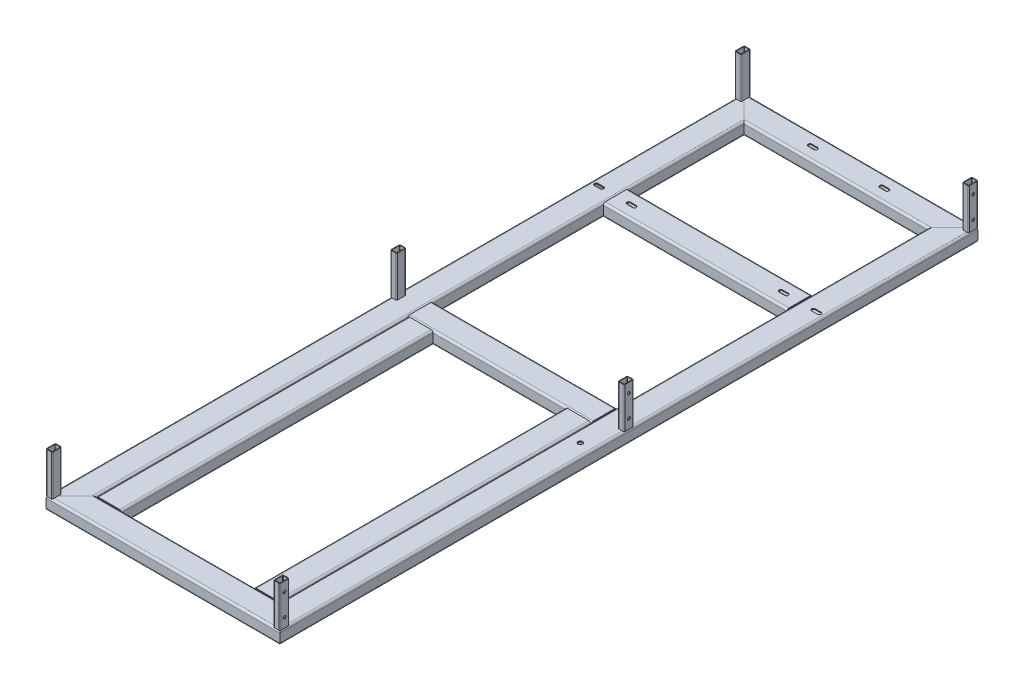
from build123d import *

# Parameters (mm, degrees)
TUBO_RETTANGOLARE_80_X_40_X_3_0_1_DEPTH      = 712.72135955
TUBO_RETTANGOLARE_80_X_40_X_3_0_1_DEPTH_BACK = 45.72135955
TUBO_RETTANGOLARE_80_X_40_X_3_0_1_2_DEPTH    = 2241.4427191
TUBO_RETTANGOLARE_80_X_40_X_3_0_1_3_DEPTH    = 758.4427191
TUBO_RETTANGOLARE_80_X_40_X_3_0_1_4_DEPTH    = 2241.4427191
TUBO_RETTANGOLARE_80_X_40_X_3_0_1_5_DEPTH    = 669
TUBO_RETTANGOLARE_80_X_40_X_3_0_1_6_DEPTH    = 669
TUBO_RETTANGOLARE_80_X_40_X_3_0_1_7_DEPTH    = 1077
TUBO_RETTANGOLARE_80_X_40_X_3_0_1_8_DEPTH    = 1077
TUBO_RETTANGOLARE_30_X_20_X_2_0_1_DEPTH      = 130
TUBO_RETTANGOLARE_30_X_20_X_2_0_1_2_DEPTH    = 130
TUBO_RETTANGOLARE_30_X_20_X_2_0_1_3_DEPTH    = 130
TUBO_RETTANGOLARE_30_X_20_X_2_0_1_4_DEPTH    = 130
TUBO_RETTANGOLARE_30_X_20_X_2_0_1_5_DEPTH    = 130
TUBO_RETTANGOLARE_30_X_20_X_2_0_1_6_DEPTH    = 130
TAGLIO_ESTRUSIONE3_REACH                     = 1185.058
SCHIZZO13_R                                  = 5.5
TAGLIO_ESTRUSIONE4_DEPTH                     = 10
SCHIZZO14_R                                  = 4.5
TAGLIO_ESTRUSIONE5_DEPTH                     = 10
SCHIZZO15_R                                  = 4.5
TAGLIO_ESTRUSIONE6_DEPTH                     = 10
SCHIZZO5_R                                   = 10
TAGLIO_ESTRUSIONE1_DEPTH                     = 333.5
SCHIZZO6_R                                   = 3
TAGLIO_ESTRUSIONE2_DEPTH                     = 4
SCHIZZO16_R                                  = 10
TAGLIO_ESTRUSIONE7_DEPTH                     = 1000
SCHIZZO17_R                                  = 7.5
TAGLIO_ESTRUSIONE8_DEPTH                     = 10
SCHIZZO18_R                                  = 7.5
TAGLIO_ESTRUSIONE9_DEPTH                     = 10


with BuildPart() as part:
    # Sketch15 → Tubo rettangolare 80 X 40 X 3.0_1 (new, two sides: drawn at the far end of the back side and taken through both)
    with BuildSketch(Plane(origin=(333.5, 0, 1075), x_dir=(0, 1, 0), z_dir=(-1, 0, 0)).offset(-TUBO_RETTANGOLARE_80_X_40_X_3_0_1_DEPTH_BACK)):
        with BuildLine():
            Line((-13.6, -40), (13.6, -40))
            ThreePointArc((13.6, -40), (18.1254834, -38.1254834), (20, -33.6))
            Line((20, -33.6), (20, 33.6))
            ThreePointArc((20, 33.6), (18.1254834, 38.1254834), (13.6, 40))
            Line((13.6, 40), (-13.6, 40))
            ThreePointArc((-13.6, 40), (-18.1254834, 38.1254834), (-20, 33.6))
            Line((-20, 33.6), (-20, -33.6))
            ThreePointArc((-20, -33.6), (-18.1254834, -38.1254834), (-13.6, -40))
        make_face()
        with BuildLine():
            Line((-13.6, -37), (13.6, -37))
            ThreePointArc((13.6, -37), (16.004163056, -36.004163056), (17, -33.6))
            Line((17, -33.6), (17, 33.6))
            ThreePointArc((17, 33.6), (16.004163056, 36.004163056), (13.6, 37))
            Line((13.6, 37), (-13.6, 37))
            ThreePointArc((-13.6, 37), (-16.004163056, 36.004163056), (-17, 33.6))
            Line((-17, 33.6), (-17, -33.6))
            ThreePointArc((-17, -33.6), (-16.004163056, -36.004163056), (-13.6, -37))
        make_face(mode=Mode.SUBTRACT)
    extrude(amount=TUBO_RETTANGOLARE_80_X_40_X_3_0_1_DEPTH + TUBO_RETTANGOLARE_80_X_40_X_3_0_1_DEPTH_BACK)

    # Tubo rettangolare 80 X 40 X 3.0_1 mitre
    split(bisect_by=Plane(origin=(333.5, 0, 1075), x_dir=(0, -1, 0), z_dir=(-0.707106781, 0, 0.707106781)), keep=Keep.TOP)

    # Tubo rettangolare 80 X 40 X 3.0_1 mi 2
    split(bisect_by=Plane(origin=(-333.5, 0, 1075), x_dir=(0, 1, 0), z_dir=(0.707106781, 0, 0.707106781)), keep=Keep.TOP)

    # Schizzo13 → Taglio-Estrusione4 (cut)
    with BuildSketch(Plane.XZ.offset(20)):
        with Locations(Location((-303.5, 1075, 0), (0, 0, 270))):
            Circle(SCHIZZO13_R)
    taglio_estrusione4 = extrude(amount=-TAGLIO_ESTRUSIONE4_DEPTH, mode=Mode.SUBTRACT)


with BuildPart() as body_2:
    # Sketch15 on segment 2 (on carried to segment 2) → Tubo rettangolare 80 X 40 X 3.0_1 2 (new body)
    with BuildSketch(Plane(origin=(-333.5, 0, 1120.72135955), x_dir=(0, 1, 0), z_dir=(0, 0, -1))):
        with BuildLine():
            Line((-13.6, -40), (13.6, -40))
            ThreePointArc((13.6, -40), (18.1254834, -38.1254834), (20, -33.6))
            Line((20, -33.6), (20, 33.6))
            ThreePointArc((20, 33.6), (18.1254834, 38.1254834), (13.6, 40))
            Line((13.6, 40), (-13.6, 40))
            ThreePointArc((-13.6, 40), (-18.1254834, 38.1254834), (-20, 33.6))
            Line((-20, 33.6), (-20, -33.6))
            ThreePointArc((-20, -33.6), (-18.1254834, -38.1254834), (-13.6, -40))
        make_face()
        with BuildLine():
            Line((-13.6, -37), (13.6, -37))
            ThreePointArc((13.6, -37), (16.004163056, -36.004163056), (17, -33.6))
            Line((17, -33.6), (17, 33.6))
            ThreePointArc((17, 33.6), (16.004163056, 36.004163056), (13.6, 37))
            Line((13.6, 37), (-13.6, 37))
            ThreePointArc((-13.6, 37), (-16.004163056, 36.004163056), (-17, 33.6))
            Line((-17, 33.6), (-17, -33.6))
            ThreePointArc((-17, -33.6), (-16.004163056, -36.004163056), (-13.6, -37))
        make_face(mode=Mode.SUBTRACT)
    extrude(amount=TUBO_RETTANGOLARE_80_X_40_X_3_0_1_2_DEPTH)

    # Tubo rettangolare 80 X 40 X 3.0_1 2 mitr
    split(bisect_by=Plane(origin=(-333.5, 0, 1075), x_dir=(0, -1, 0), z_dir=(-0.707106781, 0, -0.707106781)), keep=Keep.TOP)

    # Tubo rettangolare 80 X 40 X 3.0_1 2  2
    split(bisect_by=Plane(origin=(-333.5, 0, -1075), x_dir=(0, -1, 0), z_dir=(-0.707106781, 0, 0.707106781)), keep=Keep.TOP)


with BuildPart() as body_3:
    # Sketch15 on segment 3 (on carried to segment 3) → Tubo rettangolare 80 X 40 X 3.0_1 3 (new body)
    with BuildSketch(Plane(origin=(-379.22135955, 0, -1075), x_dir=(0, 1, 0), z_dir=(1, 0, 0))):
        with BuildLine():
            Line((-13.6, -40), (13.6, -40))
            ThreePointArc((13.6, -40), (18.1254834, -38.1254834), (20, -33.6))
            Line((20, -33.6), (20, 33.6))
            ThreePointArc((20, 33.6), (18.1254834, 38.1254834), (13.6, 40))
            Line((13.6, 40), (-13.6, 40))
            ThreePointArc((-13.6, 40), (-18.1254834, 38.1254834), (-20, 33.6))
            Line((-20, 33.6), (-20, -33.6))
            ThreePointArc((-20, -33.6), (-18.1254834, -38.1254834), (-13.6, -40))
        make_face()
        with BuildLine():
            Line((-13.6, -37), (13.6, -37))
            ThreePointArc((13.6, -37), (16.004163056, -36.004163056), (17, -33.6))
            Line((17, -33.6), (17, 33.6))
            ThreePointArc((17, 33.6), (16.004163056, 36.004163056), (13.6, 37))
            Line((13.6, 37), (-13.6, 37))
            ThreePointArc((-13.6, 37), (-16.004163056, 36.004163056), (-17, 33.6))
            Line((-17, 33.6), (-17, -33.6))
            ThreePointArc((-17, -33.6), (-16.004163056, -36.004163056), (-13.6, -37))
        make_face(mode=Mode.SUBTRACT)
    extrude(amount=TUBO_RETTANGOLARE_80_X_40_X_3_0_1_3_DEPTH)

    # Tubo rettangolare 80 X 40 X 3.0_1 3 mitr
    split(bisect_by=Plane(origin=(333.5, 0, -1075), x_dir=(0, -1, 0), z_dir=(-0.707106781, 0, -0.707106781)), keep=Keep.TOP)

    # Tubo rettangolare 80 X 40 X 3.0_1 3  2
    split(bisect_by=Plane(origin=(-333.5, 0, -1075), x_dir=(0, 1, 0), z_dir=(0.707106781, 0, -0.707106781)), keep=Keep.TOP)

    # Taglio-Estrusione3: up to this face of the body (flat: up to its plane)
    taglio_estrusione3_end = Plane(body_3.part.faces().sort_by_distance((0, -20, -1076.128395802))[0])
    # Schizzo12 → Taglio-Estrusione3 (cut, up to the picked face)
    with BuildSketch(Plane(origin=(0, 20, 0), x_dir=(1, 0, 0), z_dir=(0, 1, 0)), mode=Mode.PRIVATE) as taglio_estrusione3_sk1:
        with BuildLine():
            Line((-105.45, 1069), (-123.45, 1069))
            ThreePointArc((-123.45, 1069), (-129.45, 1075), (-123.45, 1081))
            Line((-123.45, 1081), (-105.45, 1081))
            ThreePointArc((-105.45, 1081), (-99.45, 1075), (-105.45, 1069))
        make_face()
    taglio_estrusione3_tool1 = split(extrude(taglio_estrusione3_sk1.sketch, amount=-TAGLIO_ESTRUSIONE3_REACH, mode=Mode.PRIVATE), bisect_by=taglio_estrusione3_end, keep=Keep.BOTH, mode=Mode.PRIVATE)
    taglio_estrusione3 = taglio_estrusione3_tool1.solids().sort_by(Axis((-114.45, 20, -1075), (0, -1, 0)))[0]
    add(taglio_estrusione3, mode=Mode.SUBTRACT)


with BuildPart() as body_4:
    # Sketch15 on segment 4 (on carried to segment 4) → Tubo rettangolare 80 X 40 X 3.0_1 4 (new body)
    with BuildSketch(Plane(origin=(333.5, 0, -1120.72135955), x_dir=(0, 1, 0), z_dir=(0, 0, 1))):
        with BuildLine():
            Line((-13.6, -40), (13.6, -40))
            ThreePointArc((13.6, -40), (18.1254834, -38.1254834), (20, -33.6))
            Line((20, -33.6), (20, 33.6))
            ThreePointArc((20, 33.6), (18.1254834, 38.1254834), (13.6, 40))
            Line((13.6, 40), (-13.6, 40))
            ThreePointArc((-13.6, 40), (-18.1254834, 38.1254834), (-20, 33.6))
            Line((-20, 33.6), (-20, -33.6))
            ThreePointArc((-20, -33.6), (-18.1254834, -38.1254834), (-13.6, -40))
        make_face()
        with BuildLine():
            Line((-13.6, -37), (13.6, -37))
            ThreePointArc((13.6, -37), (16.004163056, -36.004163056), (17, -33.6))
            Line((17, -33.6), (17, 33.6))
            ThreePointArc((17, 33.6), (16.004163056, 36.004163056), (13.6, 37))
            Line((13.6, 37), (-13.6, 37))
            ThreePointArc((-13.6, 37), (-16.004163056, 36.004163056), (-17, 33.6))
            Line((-17, 33.6), (-17, -33.6))
            ThreePointArc((-17, -33.6), (-16.004163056, -36.004163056), (-13.6, -37))
        make_face(mode=Mode.SUBTRACT)
    extrude(amount=TUBO_RETTANGOLARE_80_X_40_X_3_0_1_4_DEPTH)

    # Tubo rettangolare 80 X 40 X 3.0_1 4 mitr
    split(bisect_by=Plane(origin=(333.5, 0, 1075), x_dir=(0, 1, 0), z_dir=(0.707106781, 0, -0.707106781)), keep=Keep.TOP)

    # Tubo rettangolare 80 X 40 X 3.0_1 4  2
    split(bisect_by=Plane(origin=(333.5, 0, -1075), x_dir=(0, 1, 0), z_dir=(0.707106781, 0, 0.707106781)), keep=Keep.TOP)


with BuildPart() as body_5:
    # Sketch15 on segment 5 (on carried to segment 5) → Tubo rettangolare 80 X 40 X 3.0_1 5 (new body)
    with BuildSketch(Plane.YZ.offset(-334.5)):
        with BuildLine():
            Line((-13.6, -40), (13.6, -40))
            ThreePointArc((13.6, -40), (18.1254834, -38.1254834), (20, -33.6))
            Line((20, -33.6), (20, 33.6))
            ThreePointArc((20, 33.6), (18.1254834, 38.1254834), (13.6, 40))
            Line((13.6, 40), (-13.6, 40))
            ThreePointArc((-13.6, 40), (-18.1254834, 38.1254834), (-20, 33.6))
            Line((-20, 33.6), (-20, -33.6))
            ThreePointArc((-20, -33.6), (-18.1254834, -38.1254834), (-13.6, -40))
        make_face()
        with BuildLine():
            Line((-13.6, -37), (13.6, -37))
            ThreePointArc((13.6, -37), (16.004163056, -36.004163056), (17, -33.6))
            Line((17, -33.6), (17, 33.6))
            ThreePointArc((17, 33.6), (16.004163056, 36.004163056), (13.6, 37))
            Line((13.6, 37), (-13.6, 37))
            ThreePointArc((-13.6, 37), (-16.004163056, 36.004163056), (-17, 33.6))
            Line((-17, 33.6), (-17, -33.6))
            ThreePointArc((-17, -33.6), (-16.004163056, -36.004163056), (-13.6, -37))
        make_face(mode=Mode.SUBTRACT)
    extrude(amount=TUBO_RETTANGOLARE_80_X_40_X_3_0_1_5_DEPTH)

    # Tubo rettangolare 80 X 40 X 3.0_1 5 mitr
    split(bisect_by=Plane.YZ.offset(-293.5), keep=Keep.TOP)

    # Tubo rettangolare 80 X 40 X 3.0_1 5  2
    split(bisect_by=Plane(origin=(293.5, 0, 0), x_dir=(0, -1, 0), z_dir=(-1, 0, 0)), keep=Keep.TOP)

    # Schizzo16 → Taglio-Estrusione7 (cut)
    with BuildSketch(Plane.XY):
        with Locations(Location((-252, 0, 0), (0, 0, 180))):
            Circle(SCHIZZO16_R)
        with Locations(Location((252, 0, 0), (0, 0, 180))):
            Circle(SCHIZZO16_R)
    extrude(amount=TAGLIO_ESTRUSIONE7_DEPTH, mode=Mode.SUBTRACT)


with BuildPart() as body_6:
    # Sketch15 on segment 6 (on carried to segment 6) → Tubo rettangolare 80 X 40 X 3.0_1 6 (new body)
    with BuildSketch(Plane(origin=(-334.5, 0, -625), x_dir=(0, 1, 0), z_dir=(1, 0, 0))):
        with BuildLine():
            Line((-13.6, -40), (13.6, -40))
            ThreePointArc((13.6, -40), (18.1254834, -38.1254834), (20, -33.6))
            Line((20, -33.6), (20, 33.6))
            ThreePointArc((20, 33.6), (18.1254834, 38.1254834), (13.6, 40))
            Line((13.6, 40), (-13.6, 40))
            ThreePointArc((-13.6, 40), (-18.1254834, 38.1254834), (-20, 33.6))
            Line((-20, 33.6), (-20, -33.6))
            ThreePointArc((-20, -33.6), (-18.1254834, -38.1254834), (-13.6, -40))
        make_face()
        with BuildLine():
            Line((-13.6, -37), (13.6, -37))
            ThreePointArc((13.6, -37), (16.004163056, -36.004163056), (17, -33.6))
            Line((17, -33.6), (17, 33.6))
            ThreePointArc((17, 33.6), (16.004163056, 36.004163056), (13.6, 37))
            Line((13.6, 37), (-13.6, 37))
            ThreePointArc((-13.6, 37), (-16.004163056, 36.004163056), (-17, 33.6))
            Line((-17, 33.6), (-17, -33.6))
            ThreePointArc((-17, -33.6), (-16.004163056, -36.004163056), (-13.6, -37))
        make_face(mode=Mode.SUBTRACT)
    extrude(amount=TUBO_RETTANGOLARE_80_X_40_X_3_0_1_6_DEPTH)

    # Tubo rettangolare 80 X 40 X 3.0_1 6 mitr
    split(bisect_by=Plane(origin=(-293.5, 0, -625), x_dir=(0, 1, 0), z_dir=(1, 0, 0)), keep=Keep.TOP)

    # Tubo rettangolare 80 X 40 X 3.0_1 6  2
    split(bisect_by=Plane(origin=(293.5, 0, -625), x_dir=(0, -1, 0), z_dir=(-1, 0, 0)), keep=Keep.TOP)


with BuildPart() as body_7:
    # Sketch15 on segment 7 (on carried to segment 7) → Tubo rettangolare 80 X 40 X 3.0_1 7 (new body)
    with BuildSketch(Plane(origin=(252, 0, -1), x_dir=(0, 1, 0), z_dir=(0, 0, 1))):
        with BuildLine():
            Line((-13.6, -40), (13.6, -40))
            ThreePointArc((13.6, -40), (18.1254834, -38.1254834), (20, -33.6))
            Line((20, -33.6), (20, 33.6))
            ThreePointArc((20, 33.6), (18.1254834, 38.1254834), (13.6, 40))
            Line((13.6, 40), (-13.6, 40))
            ThreePointArc((-13.6, 40), (-18.1254834, 38.1254834), (-20, 33.6))
            Line((-20, 33.6), (-20, -33.6))
            ThreePointArc((-20, -33.6), (-18.1254834, -38.1254834), (-13.6, -40))
        make_face()
        with BuildLine():
            Line((-13.6, -37), (13.6, -37))
            ThreePointArc((13.6, -37), (16.004163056, -36.004163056), (17, -33.6))
            Line((17, -33.6), (17, 33.6))
            ThreePointArc((17, 33.6), (16.004163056, 36.004163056), (13.6, 37))
            Line((13.6, 37), (-13.6, 37))
            ThreePointArc((-13.6, 37), (-16.004163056, 36.004163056), (-17, 33.6))
            Line((-17, 33.6), (-17, -33.6))
            ThreePointArc((-17, -33.6), (-16.004163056, -36.004163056), (-13.6, -37))
        make_face(mode=Mode.SUBTRACT)
    extrude(amount=TUBO_RETTANGOLARE_80_X_40_X_3_0_1_7_DEPTH)

    # Tubo rettangolare 80 X 40 X 3.0_1 7 mitr
    split(bisect_by=Plane(origin=(252, 0, 40), x_dir=(0, -1, 0), z_dir=(0, 0, 1)), keep=Keep.TOP)

    # Tubo rettangolare 80 X 40 X 3.0_1 7  2
    split(bisect_by=Plane(origin=(252, 0, 1035), x_dir=(0, 1, 0), z_dir=(0, 0, -1)), keep=Keep.TOP)


with BuildPart() as body_8:
    # Sketch15 on segment 8 (on carried to segment 8) → Tubo rettangolare 80 X 40 X 3.0_1 8 (new body)
    with BuildSketch(Plane(origin=(-252, 0, -1), x_dir=(0, 1, 0), z_dir=(0, 0, 1))):
        with BuildLine():
            Line((-13.6, -40), (13.6, -40))
            ThreePointArc((13.6, -40), (18.1254834, -38.1254834), (20, -33.6))
            Line((20, -33.6), (20, 33.6))
            ThreePointArc((20, 33.6), (18.1254834, 38.1254834), (13.6, 40))
            Line((13.6, 40), (-13.6, 40))
            ThreePointArc((-13.6, 40), (-18.1254834, 38.1254834), (-20, 33.6))
            Line((-20, 33.6), (-20, -33.6))
            ThreePointArc((-20, -33.6), (-18.1254834, -38.1254834), (-13.6, -40))
        make_face()
        with BuildLine():
            Line((-13.6, -37), (13.6, -37))
            ThreePointArc((13.6, -37), (16.004163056, -36.004163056), (17, -33.6))
            Line((17, -33.6), (17, 33.6))
            ThreePointArc((17, 33.6), (16.004163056, 36.004163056), (13.6, 37))
            Line((13.6, 37), (-13.6, 37))
            ThreePointArc((-13.6, 37), (-16.004163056, 36.004163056), (-17, 33.6))
            Line((-17, 33.6), (-17, -33.6))
            ThreePointArc((-17, -33.6), (-16.004163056, -36.004163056), (-13.6, -37))
        make_face(mode=Mode.SUBTRACT)
    extrude(amount=TUBO_RETTANGOLARE_80_X_40_X_3_0_1_8_DEPTH)

    # Tubo rettangolare 80 X 40 X 3.0_1 8 mitr
    split(bisect_by=Plane(origin=(-252, 0, 40), x_dir=(0, -1, 0), z_dir=(0, 0, 1)), keep=Keep.TOP)

    # Tubo rettangolare 80 X 40 X 3.0_1 8  2
    split(bisect_by=Plane(origin=(-252, 0, 1035), x_dir=(0, 1, 0), z_dir=(0, 0, -1)), keep=Keep.TOP)


with BuildPart() as body_9:
    # Sketch11 → Tubo rettangolare 30 X 20 X 2.0_1 (new body)
    with BuildSketch(Plane(origin=(-363.5, 20, 1100), x_dir=(1, 0, 0), z_dir=(0, 1, 0))):
        with BuildLine():
            Line((-6.8, -15), (6.8, -15))
            ThreePointArc((6.8, -15), (9.0627417, -14.0627417), (10, -11.8))
            Line((10, -11.8), (10, 11.8))
            ThreePointArc((10, 11.8), (9.0627417, 14.0627417), (6.8, 15))
            Line((6.8, 15), (-6.8, 15))
            ThreePointArc((-6.8, 15), (-9.0627417, 14.0627417), (-10, 11.8))
            Line((-10, 11.8), (-10, -11.8))
            ThreePointArc((-10, -11.8), (-9.0627417, -14.0627417), (-6.8, -15))
        make_face()
        with BuildLine():
            Line((-6.8, -13), (6.8, -13))
            ThreePointArc((6.8, -13), (7.648528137, -12.648528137), (8, -11.8))
            Line((8, -11.8), (8, 11.8))
            ThreePointArc((8, 11.8), (7.648528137, 12.648528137), (6.8, 13))
            Line((6.8, 13), (-6.8, 13))
            ThreePointArc((-6.8, 13), (-7.648528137, 12.648528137), (-8, 11.8))
            Line((-8, 11.8), (-8, -11.8))
            ThreePointArc((-8, -11.8), (-7.648528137, -12.648528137), (-6.8, -13))
        make_face(mode=Mode.SUBTRACT)
    extrude(amount=TUBO_RETTANGOLARE_30_X_20_X_2_0_1_DEPTH)

    # Schizzo15 → Taglio-Estrusione6 (cut)
    with BuildSketch(Plane.ZY.offset(373.5)):
        with Locations(Location((1100, 120, 0), (0, 0, 180))):
            Circle(SCHIZZO15_R)
    taglio_estrusione6 = extrude(amount=-TAGLIO_ESTRUSIONE6_DEPTH, mode=Mode.SUBTRACT)


with BuildPart() as body_10:
    # Sketch11 on segment 2 (on carried to segment 2) → Tubo rettangolare 30 X 20 X 2.0_1 2 (new body)
    with BuildSketch(Plane(origin=(363.5, 20, 1100), x_dir=(1, 0, 0), z_dir=(0, 1, 0))):
        with BuildLine():
            Line((-6.8, -15), (6.8, -15))
            ThreePointArc((6.8, -15), (9.0627417, -14.0627417), (10, -11.8))
            Line((10, -11.8), (10, 11.8))
            ThreePointArc((10, 11.8), (9.0627417, 14.0627417), (6.8, 15))
            Line((6.8, 15), (-6.8, 15))
            ThreePointArc((-6.8, 15), (-9.0627417, 14.0627417), (-10, 11.8))
            Line((-10, 11.8), (-10, -11.8))
            ThreePointArc((-10, -11.8), (-9.0627417, -14.0627417), (-6.8, -15))
        make_face()
        with BuildLine():
            Line((-6.8, -13), (6.8, -13))
            ThreePointArc((6.8, -13), (7.648528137, -12.648528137), (8, -11.8))
            Line((8, -11.8), (8, 11.8))
            ThreePointArc((8, 11.8), (7.648528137, 12.648528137), (6.8, 13))
            Line((6.8, 13), (-6.8, 13))
            ThreePointArc((-6.8, 13), (-7.648528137, 12.648528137), (-8, 11.8))
            Line((-8, 11.8), (-8, -11.8))
            ThreePointArc((-8, -11.8), (-7.648528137, -12.648528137), (-6.8, -13))
        make_face(mode=Mode.SUBTRACT)
    extrude(amount=TUBO_RETTANGOLARE_30_X_20_X_2_0_1_2_DEPTH)

    # Schizzo14 → Taglio-Estrusione5 (cut)
    with BuildSketch(Plane(origin=(373.5, 0, 0), x_dir=(0, 0, -1), z_dir=(1, 0, 0))):
        with Locations((-1100, 120)):
            Circle(SCHIZZO14_R)
    taglio_estrusione5 = extrude(amount=-TAGLIO_ESTRUSIONE5_DEPTH, mode=Mode.SUBTRACT)


with BuildPart() as body_11:
    # Sketch11 on segment 3 (on carried to segment 3) → Tubo rettangolare 30 X 20 X 2.0_1 3 (new body)
    with BuildSketch(Plane(origin=(363.5, 20, -1100), x_dir=(1, 0, 0), z_dir=(0, 1, 0))):
        with BuildLine():
            Line((-6.8, -15), (6.8, -15))
            ThreePointArc((6.8, -15), (9.0627417, -14.0627417), (10, -11.8))
            Line((10, -11.8), (10, 11.8))
            ThreePointArc((10, 11.8), (9.0627417, 14.0627417), (6.8, 15))
            Line((6.8, 15), (-6.8, 15))
            ThreePointArc((-6.8, 15), (-9.0627417, 14.0627417), (-10, 11.8))
            Line((-10, 11.8), (-10, -11.8))
            ThreePointArc((-10, -11.8), (-9.0627417, -14.0627417), (-6.8, -15))
        make_face()
        with BuildLine():
            Line((-6.8, -13), (6.8, -13))
            ThreePointArc((6.8, -13), (7.648528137, -12.648528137), (8, -11.8))
            Line((8, -11.8), (8, 11.8))
            ThreePointArc((8, 11.8), (7.648528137, 12.648528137), (6.8, 13))
            Line((6.8, 13), (-6.8, 13))
            ThreePointArc((-6.8, 13), (-7.648528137, 12.648528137), (-8, 11.8))
            Line((-8, 11.8), (-8, -11.8))
            ThreePointArc((-8, -11.8), (-7.648528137, -12.648528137), (-6.8, -13))
        make_face(mode=Mode.SUBTRACT)
    extrude(amount=TUBO_RETTANGOLARE_30_X_20_X_2_0_1_3_DEPTH)


with BuildPart() as body_12:
    # Sketch11 on segment 4 (on carried to segment 4) → Tubo rettangolare 30 X 20 X 2.0_1 4 (new body)
    with BuildSketch(Plane(origin=(-363.5, 20, -1100), x_dir=(1, 0, 0), z_dir=(0, 1, 0))):
        with BuildLine():
            Line((-6.8, -15), (6.8, -15))
            ThreePointArc((6.8, -15), (9.0627417, -14.0627417), (10, -11.8))
            Line((10, -11.8), (10, 11.8))
            ThreePointArc((10, 11.8), (9.0627417, 14.0627417), (6.8, 15))
            Line((6.8, 15), (-6.8, 15))
            ThreePointArc((-6.8, 15), (-9.0627417, 14.0627417), (-10, 11.8))
            Line((-10, 11.8), (-10, -11.8))
            ThreePointArc((-10, -11.8), (-9.0627417, -14.0627417), (-6.8, -15))
        make_face()
        with BuildLine():
            Line((-6.8, -13), (6.8, -13))
            ThreePointArc((6.8, -13), (7.648528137, -12.648528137), (8, -11.8))
            Line((8, -11.8), (8, 11.8))
            ThreePointArc((8, 11.8), (7.648528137, 12.648528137), (6.8, 13))
            Line((6.8, 13), (-6.8, 13))
            ThreePointArc((-6.8, 13), (-7.648528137, 12.648528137), (-8, 11.8))
            Line((-8, 11.8), (-8, -11.8))
            ThreePointArc((-8, -11.8), (-7.648528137, -12.648528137), (-6.8, -13))
        make_face(mode=Mode.SUBTRACT)
    extrude(amount=TUBO_RETTANGOLARE_30_X_20_X_2_0_1_4_DEPTH)


with BuildPart() as body_13:
    # Sketch11 on segment 5 (on carried to segment 5) → Tubo rettangolare 30 X 20 X 2.0_1 5 (new body)
    with BuildSketch(Plane(origin=(-363.5, 20, 0), x_dir=(1, 0, 0), z_dir=(0, 1, 0))):
        with BuildLine():
            Line((-6.8, -15), (6.8, -15))
            ThreePointArc((6.8, -15), (9.0627417, -14.0627417), (10, -11.8))
            Line((10, -11.8), (10, 11.8))
            ThreePointArc((10, 11.8), (9.0627417, 14.0627417), (6.8, 15))
            Line((6.8, 15), (-6.8, 15))
            ThreePointArc((-6.8, 15), (-9.0627417, 14.0627417), (-10, 11.8))
            Line((-10, 11.8), (-10, -11.8))
            ThreePointArc((-10, -11.8), (-9.0627417, -14.0627417), (-6.8, -15))
        make_face()
        with BuildLine():
            Line((-6.8, -13), (6.8, -13))
            ThreePointArc((6.8, -13), (7.648528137, -12.648528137), (8, -11.8))
            Line((8, -11.8), (8, 11.8))
            ThreePointArc((8, 11.8), (7.648528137, 12.648528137), (6.8, 13))
            Line((6.8, 13), (-6.8, 13))
            ThreePointArc((-6.8, 13), (-7.648528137, 12.648528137), (-8, 11.8))
            Line((-8, 11.8), (-8, -11.8))
            ThreePointArc((-8, -11.8), (-7.648528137, -12.648528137), (-6.8, -13))
        make_face(mode=Mode.SUBTRACT)
    extrude(amount=TUBO_RETTANGOLARE_30_X_20_X_2_0_1_5_DEPTH)


with BuildPart() as body_14:
    # Sketch11 on segment 6 (on carried to segment 6) → Tubo rettangolare 30 X 20 X 2.0_1 6 (new body)
    with BuildSketch(Plane(origin=(363.5, 20, 0), x_dir=(1, 0, 0), z_dir=(0, 1, 0))):
        with BuildLine():
            Line((-6.8, -15), (6.8, -15))
            ThreePointArc((6.8, -15), (9.0627417, -14.0627417), (10, -11.8))
            Line((10, -11.8), (10, 11.8))
            ThreePointArc((10, 11.8), (9.0627417, 14.0627417), (6.8, 15))
            Line((6.8, 15), (-6.8, 15))
            ThreePointArc((-6.8, 15), (-9.0627417, 14.0627417), (-10, 11.8))
            Line((-10, 11.8), (-10, -11.8))
            ThreePointArc((-10, -11.8), (-9.0627417, -14.0627417), (-6.8, -15))
        make_face()
        with BuildLine():
            Line((-6.8, -13), (6.8, -13))
            ThreePointArc((6.8, -13), (7.648528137, -12.648528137), (8, -11.8))
            Line((8, -11.8), (8, 11.8))
            ThreePointArc((8, 11.8), (7.648528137, 12.648528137), (6.8, 13))
            Line((6.8, 13), (-6.8, 13))
            ThreePointArc((-6.8, 13), (-7.648528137, 12.648528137), (-8, 11.8))
            Line((-8, 11.8), (-8, -11.8))
            ThreePointArc((-8, -11.8), (-7.648528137, -12.648528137), (-6.8, -13))
        make_face(mode=Mode.SUBTRACT)
    extrude(amount=TUBO_RETTANGOLARE_30_X_20_X_2_0_1_6_DEPTH)


with BuildPart() as ripetizione_schizzo2_tool:
    # Ripetizione-Schizzo2: Taglio-Estrusione3 at 5 more places
    with Locations((228.9, 0, 0), (-232.5, 0, 450), (-128.6, 0, 450), (357.5, 0, 450), (461.4, 0, 450)):
        add(taglio_estrusione3)


with BuildPart() as body_2_1:
    add(body_2.part)

    # Ripetizione-Schizzo2: cut by ripetizione_schizzo2_tool
    add(ripetizione_schizzo2_tool.part, mode=Mode.SUBTRACT)


with BuildPart() as body_3_1:
    add(body_3.part)

    # Ripetizione-Schizzo2: cut by ripetizione_schizzo2_tool
    add(ripetizione_schizzo2_tool.part, mode=Mode.SUBTRACT)


with BuildPart() as body_4_1:
    add(body_4.part)

    # Ripetizione-Schizzo2: cut by ripetizione_schizzo2_tool
    add(ripetizione_schizzo2_tool.part, mode=Mode.SUBTRACT)


with BuildPart() as body_6_1:
    add(body_6.part)

    # Ripetizione-Schizzo2: cut by ripetizione_schizzo2_tool
    add(ripetizione_schizzo2_tool.part, mode=Mode.SUBTRACT)


with BuildPart() as ripetizione_schizzo3_tool:
    # Ripetizione-Schizzo3: Taglio-Estrusione4 at 5 more places
    with Locations((637, 0, -1075), (607, 0, -2150), (607, 0, 0), (0, 0, -2150), (-30, 0, -1075)):
        add(taglio_estrusione4)


with BuildPart() as part_1:
    add(part.part)

    # Ripetizione-Schizzo3: cut by ripetizione_schizzo3_tool
    add(ripetizione_schizzo3_tool.part, mode=Mode.SUBTRACT)

    # Schizzo17 → Taglio-Estrusione8 (cut)
    with BuildSketch(Plane(origin=(0, 0, 1035), x_dir=(-1, 0, 0), z_dir=(0, 0, -1))):
        with Locations((-120, 0)):
            Circle(SCHIZZO17_R)
    extrude(amount=-TAGLIO_ESTRUSIONE8_DEPTH, mode=Mode.SUBTRACT)


with BuildPart() as body_2_2:
    add(body_2_1.part)

    # Ripetizione-Schizzo3: cut by ripetizione_schizzo3_tool
    add(ripetizione_schizzo3_tool.part, mode=Mode.SUBTRACT)


with BuildPart() as body_3_2:
    add(body_3_1.part)

    # Ripetizione-Schizzo3: cut by ripetizione_schizzo3_tool
    add(ripetizione_schizzo3_tool.part, mode=Mode.SUBTRACT)


with BuildPart() as body_4_2:
    add(body_4_1.part)

    # Ripetizione-Schizzo3: cut by ripetizione_schizzo3_tool
    add(ripetizione_schizzo3_tool.part, mode=Mode.SUBTRACT)


with BuildPart() as ripetizione_schizzo4_tool:
    # Ripetizione-Schizzo4: Taglio-Estrusione5 at 5 more places
    with Locations((0, -70, 0), (0, 0, -2200), (0, 0, -1100), (0, -70, -2200), (0, -70, -1100)):
        add(taglio_estrusione5)


with BuildPart() as body_10_1:
    add(body_10.part)

    # Ripetizione-Schizzo4: cut by ripetizione_schizzo4_tool
    add(ripetizione_schizzo4_tool.part, mode=Mode.SUBTRACT)


with BuildPart() as body_11_1:
    add(body_11.part)

    # Ripetizione-Schizzo4: cut by ripetizione_schizzo4_tool
    add(ripetizione_schizzo4_tool.part, mode=Mode.SUBTRACT)


with BuildPart() as body_14_1:
    add(body_14.part)

    # Ripetizione-Schizzo4: cut by ripetizione_schizzo4_tool
    add(ripetizione_schizzo4_tool.part, mode=Mode.SUBTRACT)


with BuildPart() as ripetizione_schizzo5_tool:
    # Ripetizione-Schizzo5: Taglio-Estrusione6 at 5 more places
    with Locations((0, -70, 0), (0, -70, -2200), (0, 0, -2200), (0, 0, -1100), (0, -70, -1100)):
        add(taglio_estrusione6)


with BuildPart() as body_9_1:
    add(body_9.part)

    # Ripetizione-Schizzo5: cut by ripetizione_schizzo5_tool
    add(ripetizione_schizzo5_tool.part, mode=Mode.SUBTRACT)


with BuildPart() as body_12_1:
    add(body_12.part)

    # Ripetizione-Schizzo5: cut by ripetizione_schizzo5_tool
    add(ripetizione_schizzo5_tool.part, mode=Mode.SUBTRACT)


with BuildPart() as body_13_1:
    add(body_13.part)

    # Ripetizione-Schizzo5: cut by ripetizione_schizzo5_tool
    add(ripetizione_schizzo5_tool.part, mode=Mode.SUBTRACT)


with BuildPart() as taglio_estrusione1_tool:
    # Schizzo5 → Taglio-Estrusione1 (new, symmetric)
    with BuildSketch(Plane(origin=(0, 0, 0), x_dir=(0, 0, -1), z_dir=(1, 0, 0))):
        Circle(SCHIZZO5_R)
        with Locations((625, 0)):
            Circle(SCHIZZO5_R)
    extrude(amount=TAGLIO_ESTRUSIONE1_DEPTH, both=True)


with BuildPart() as body_2_3:
    add(body_2_2.part)

    # Taglio-Estrusione1: cut by taglio_estrusione1_tool
    add(taglio_estrusione1_tool.part, mode=Mode.SUBTRACT)


with BuildPart() as body_4_3:
    add(body_4_2.part)

    # Taglio-Estrusione1: cut by taglio_estrusione1_tool
    add(taglio_estrusione1_tool.part, mode=Mode.SUBTRACT)


with BuildPart() as taglio_estrusione2_tool:
    # Schizzo6 → Taglio-Estrusione2 (new body)
    with BuildSketch(Plane(origin=(0, 20, 0), x_dir=(1, 0, 0), z_dir=(0, 1, 0))):
        with Locations(Location((363.5, -1095, 0), (0, 0, 180))):
            Circle(SCHIZZO6_R)
        with Locations((-363.5, -1095)):
            Circle(SCHIZZO6_R)
        with Locations(Location((-363.5, 1095, 0), (0, 0, 180))):
            Circle(SCHIZZO6_R)
        with Locations((363.5, 1095)):
            Circle(SCHIZZO6_R)
        with Locations(Location((-363.5, 0, 0), (0, 0, 180))):
            Circle(SCHIZZO6_R)
        with Locations((363.5, 0)):
            Circle(SCHIZZO6_R)
    extrude(amount=-TAGLIO_ESTRUSIONE2_DEPTH)


with BuildPart() as body_2_4:
    add(body_2_3.part)

    # Taglio-Estrusione2: cut by taglio_estrusione2_tool
    add(taglio_estrusione2_tool.part, mode=Mode.SUBTRACT)


with BuildPart() as body_4_4:
    add(body_4_3.part)

    # Taglio-Estrusione2: cut by taglio_estrusione2_tool
    add(taglio_estrusione2_tool.part, mode=Mode.SUBTRACT)

    # Schizzo18 → Taglio-Estrusione9 (cut)
    with BuildSketch(Plane(origin=(0, 20, 0), x_dir=(1, 0, 0), z_dir=(0, 1, 0))):
        with Locations(Location((333.5, -115, 0), (0, 0, 180))):
            Circle(SCHIZZO18_R)
    extrude(amount=-TAGLIO_ESTRUSIONE9_DEPTH, mode=Mode.SUBTRACT)


solid = Compound([body_5.part, body_7.part, body_8.part, body_6_1.part, part_1.part, body_3_2.part, body_10_1.part, body_11_1.part, body_14_1.part, body_9_1.part, body_12_1.part, body_13_1.part, body_2_4.part, body_4_4.part])
